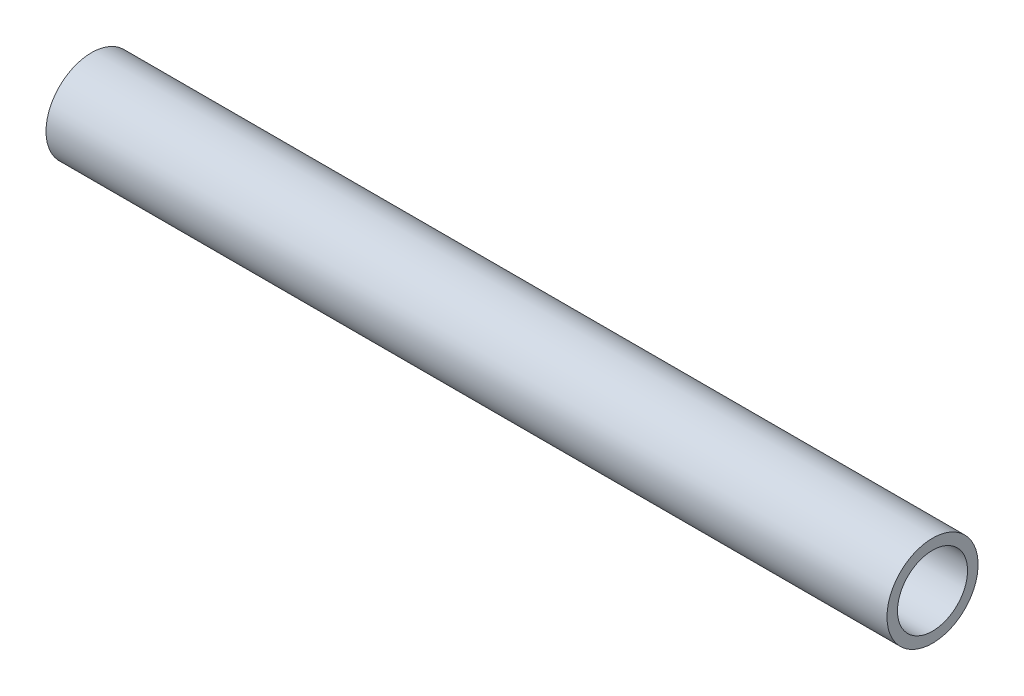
ISO-10303-21;
HEADER;
FILE_DESCRIPTION(('STEP AP214'),'2;1');
FILE_NAME('part.step','',(''),(''),'','','');
FILE_SCHEMA(('AUTOMOTIVE_DESIGN { 1 0 10303 214 1 1 1 1 }'));
ENDSEC;
DATA;
#1=APPLICATION_CONTEXT('core data for automotive mechanical design processes');
#2=APPLICATION_PROTOCOL_DEFINITION('international standard','automotive_design',2000,#1);
#3=PRODUCT_CONTEXT('',#1,'mechanical');
#4=PRODUCT('Part','Part','',(#3));
#5=PRODUCT_RELATED_PRODUCT_CATEGORY('part','',(#4));
#6=PRODUCT_DEFINITION_FORMATION('','',#4);
#7=PRODUCT_DEFINITION_CONTEXT('part definition',#1,'design');
#8=PRODUCT_DEFINITION('design','',#6,#7);
#9=PRODUCT_DEFINITION_SHAPE('','',#8);
#10=(LENGTH_UNIT() NAMED_UNIT(*) SI_UNIT(.MILLI.,.METRE.));
#11=(NAMED_UNIT(*) PLANE_ANGLE_UNIT() SI_UNIT($,.RADIAN.));
#12=(NAMED_UNIT(*) SI_UNIT($,.STERADIAN.) SOLID_ANGLE_UNIT());
#13=UNCERTAINTY_MEASURE_WITH_UNIT(LENGTH_MEASURE(1.E-05),#10,'distance_accuracy_value','');
#14=(GEOMETRIC_REPRESENTATION_CONTEXT(3) GLOBAL_UNCERTAINTY_ASSIGNED_CONTEXT((#13)) GLOBAL_UNIT_ASSIGNED_CONTEXT((#10,
#11,#12)) REPRESENTATION_CONTEXT('',''));
#15=CARTESIAN_POINT('',(0.,0.,0.));
#16=DIRECTION('',(0.,0.,1.));
#17=DIRECTION('',(1.,0.,0.));
#18=AXIS2_PLACEMENT_3D('',#15,#16,#17);
#19=CARTESIAN_POINT('',(304.800000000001,0.,0.));
#20=DIRECTION('',(-1.,0.,0.));
#21=DIRECTION('',(0.,0.,1.00000000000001));
#22=AXIS2_PLACEMENT_3D('',#19,#20,#21);
#23=CYLINDRICAL_SURFACE('',#22,12.7);
#24=CARTESIAN_POINT('',(304.800000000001,0.,0.));
#25=DIRECTION('',(1.,0.,0.));
#26=DIRECTION('',(0.,0.,-1.00000000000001));
#27=AXIS2_PLACEMENT_3D('',#24,#25,#26);
#28=CIRCLE('',#27,12.7);
#29=CARTESIAN_POINT('',(304.800000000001,0.,12.7000000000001));
#30=VERTEX_POINT('',#29);
#31=EDGE_CURVE('E40',#30,#30,#28,.T.);
#32=CARTESIAN_POINT('',(0.,0.,0.));
#33=DIRECTION('',(1.,0.,0.));
#34=DIRECTION('',(0.,0.,-1.00000000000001));
#35=AXIS2_PLACEMENT_3D('',#32,#33,#34);
#36=CIRCLE('',#35,12.7);
#37=CARTESIAN_POINT('',(0.,0.,12.7000000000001));
#38=VERTEX_POINT('',#37);
#39=EDGE_CURVE('E46',#38,#38,#36,.T.);
#40=CARTESIAN_POINT('',(304.800000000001,0.,12.7000000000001));
#41=CARTESIAN_POINT('',(301.625000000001,0.,12.7000000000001));
#42=CARTESIAN_POINT('',(298.450000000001,0.,12.7000000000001));
#43=CARTESIAN_POINT('',(292.100000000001,0.,12.7000000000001));
#44=CARTESIAN_POINT('',(288.925000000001,0.,12.7000000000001));
#45=CARTESIAN_POINT('',(282.575000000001,0.,12.7000000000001));
#46=CARTESIAN_POINT('',(279.400000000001,0.,12.7000000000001));
#47=CARTESIAN_POINT('',(273.050000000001,0.,12.7000000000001));
#48=CARTESIAN_POINT('',(269.875000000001,0.,12.7000000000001));
#49=CARTESIAN_POINT('',(263.525000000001,0.,12.7000000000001));
#50=CARTESIAN_POINT('',(260.350000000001,0.,12.7000000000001));
#51=CARTESIAN_POINT('',(254.000000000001,0.,12.7000000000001));
#52=CARTESIAN_POINT('',(250.825000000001,0.,12.7000000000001));
#53=CARTESIAN_POINT('',(244.475000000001,0.,12.7000000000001));
#54=CARTESIAN_POINT('',(241.300000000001,0.,12.7000000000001));
#55=CARTESIAN_POINT('',(234.950000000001,0.,12.7000000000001));
#56=CARTESIAN_POINT('',(231.775000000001,0.,12.7000000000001));
#57=CARTESIAN_POINT('',(225.425000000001,0.,12.7000000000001));
#58=CARTESIAN_POINT('',(222.250000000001,0.,12.7000000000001));
#59=CARTESIAN_POINT('',(215.900000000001,0.,12.7000000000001));
#60=CARTESIAN_POINT('',(212.725000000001,0.,12.7000000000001));
#61=CARTESIAN_POINT('',(206.375000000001,0.,12.7000000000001));
#62=CARTESIAN_POINT('',(203.200000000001,0.,12.7000000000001));
#63=CARTESIAN_POINT('',(196.850000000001,0.,12.7000000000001));
#64=CARTESIAN_POINT('',(193.675000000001,0.,12.7000000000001));
#65=CARTESIAN_POINT('',(187.325000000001,0.,12.7000000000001));
#66=CARTESIAN_POINT('',(184.150000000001,0.,12.7000000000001));
#67=CARTESIAN_POINT('',(177.800000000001,0.,12.7000000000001));
#68=CARTESIAN_POINT('',(174.625000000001,0.,12.7000000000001));
#69=CARTESIAN_POINT('',(168.275000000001,0.,12.7000000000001));
#70=CARTESIAN_POINT('',(165.100000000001,0.,12.7000000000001));
#71=CARTESIAN_POINT('',(158.750000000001,0.,12.7000000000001));
#72=CARTESIAN_POINT('',(155.575000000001,0.,12.7000000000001));
#73=CARTESIAN_POINT('',(149.225000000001,0.,12.7000000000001));
#74=CARTESIAN_POINT('',(146.050000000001,0.,12.7000000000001));
#75=CARTESIAN_POINT('',(139.700000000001,0.,12.7000000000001));
#76=CARTESIAN_POINT('',(136.525000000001,0.,12.7000000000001));
#77=CARTESIAN_POINT('',(130.175,0.,12.7000000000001));
#78=CARTESIAN_POINT('',(127.,0.,12.7000000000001));
#79=CARTESIAN_POINT('',(120.65,0.,12.7000000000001));
#80=CARTESIAN_POINT('',(117.475,0.,12.7000000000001));
#81=CARTESIAN_POINT('',(111.125,0.,12.7000000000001));
#82=CARTESIAN_POINT('',(107.95,0.,12.7000000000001));
#83=CARTESIAN_POINT('',(101.6,0.,12.7000000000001));
#84=CARTESIAN_POINT('',(98.4250000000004,0.,12.7000000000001));
#85=CARTESIAN_POINT('',(92.0750000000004,0.,12.7000000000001));
#86=CARTESIAN_POINT('',(88.9000000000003,0.,12.7000000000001));
#87=CARTESIAN_POINT('',(82.5500000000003,0.,12.7000000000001));
#88=CARTESIAN_POINT('',(79.3750000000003,0.,12.7000000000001));
#89=CARTESIAN_POINT('',(73.0250000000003,0.,12.7000000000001));
#90=CARTESIAN_POINT('',(69.8500000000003,0.,12.7000000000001));
#91=CARTESIAN_POINT('',(63.5000000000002,0.,12.7000000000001));
#92=CARTESIAN_POINT('',(60.3250000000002,0.,12.7000000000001));
#93=CARTESIAN_POINT('',(53.9750000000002,0.,12.7000000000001));
#94=CARTESIAN_POINT('',(50.8000000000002,0.,12.7000000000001));
#95=CARTESIAN_POINT('',(44.4500000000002,0.,12.7000000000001));
#96=CARTESIAN_POINT('',(41.2750000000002,0.,12.7000000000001));
#97=CARTESIAN_POINT('',(34.9250000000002,0.,12.7000000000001));
#98=CARTESIAN_POINT('',(31.7500000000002,0.,12.7000000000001));
#99=CARTESIAN_POINT('',(25.4000000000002,0.,12.7000000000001));
#100=CARTESIAN_POINT('',(22.2250000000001,0.,12.7000000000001));
#101=CARTESIAN_POINT('',(15.8750000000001,0.,12.7000000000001));
#102=CARTESIAN_POINT('',(12.7000000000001,0.,12.7000000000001));
#103=CARTESIAN_POINT('',(6.3500000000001,0.,12.7000000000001));
#104=CARTESIAN_POINT('',(3.17500000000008,0.,12.7000000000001));
#105=CARTESIAN_POINT('',(0.,0.,12.7000000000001));
#106=B_SPLINE_CURVE_WITH_KNOTS('',3,(#40,#41,#42,#43,#44,#45,#46,#47,#48,#49,#50,#51,#52,#53,
#54,#55,#56,#57,#58,#59,#60,#61,#62,#63,#64,#65,#66,#67,#68,#69,#70,#71,#72,#73,#74,#75,#76,#77,
#78,#79,#80,#81,#82,#83,#84,#85,#86,#87,#88,#89,#90,#91,#92,#93,#94,#95,#96,#97,#98,#99,#100,
#101,#102,#103,#104,#105),.UNSPECIFIED.,.F.,.F.,(4,2,2,2,2,2,2,2,2,2,2,2,2,2,2,2,2,2,2,2,2,2,2,
2,2,2,2,2,2,2,2,2,4),(0.,9.52500000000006,19.0500000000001,28.5750000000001,38.1000000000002,
47.6250000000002,57.1500000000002,66.6750000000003,76.2000000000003,85.7250000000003,
95.2500000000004,104.775,114.3,123.825,133.350000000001,142.875000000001,152.400000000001,
161.925000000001,171.450000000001,180.975000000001,190.500000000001,200.025000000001,
209.550000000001,219.075000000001,228.600000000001,238.125000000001,247.650000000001,
257.175000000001,266.700000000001,276.225000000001,285.750000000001,295.275000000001,
304.800000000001),.UNSPECIFIED.);
#107=EDGE_CURVE('BSEAM33',#30,#38,#106,.T.);
#108=ORIENTED_EDGE('',*,*,#31,.T.);
#109=ORIENTED_EDGE('',*,*,#39,.F.);
#110=ORIENTED_EDGE('',*,*,#107,.T.);
#111=ORIENTED_EDGE('',*,*,#107,.F.);
#112=EDGE_LOOP('',(#108,#110,#109,#111));
#113=FACE_BOUND('',#112,.T.);
#114=ADVANCED_FACE('F33',(#113),#23,.F.);
#115=CARTESIAN_POINT('',(304.800000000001,0.,0.));
#116=DIRECTION('',(-1.,0.,0.));
#117=DIRECTION('',(0.,0.,1.00000000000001));
#118=AXIS2_PLACEMENT_3D('',#115,#116,#117);
#119=CYLINDRICAL_SURFACE('',#118,16.51);
#120=CARTESIAN_POINT('',(304.800000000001,0.,0.));
#121=DIRECTION('',(1.,0.,0.));
#122=DIRECTION('',(0.,0.,-1.00000000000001));
#123=AXIS2_PLACEMENT_3D('',#120,#121,#122);
#124=CIRCLE('',#123,16.51);
#125=CARTESIAN_POINT('',(304.800000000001,0.,16.5100000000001));
#126=VERTEX_POINT('',#125);
#127=EDGE_CURVE('E10',#126,#126,#124,.T.);
#128=CARTESIAN_POINT('',(0.,0.,0.));
#129=DIRECTION('',(1.,0.,0.));
#130=DIRECTION('',(0.,0.,-1.00000000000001));
#131=AXIS2_PLACEMENT_3D('',#128,#129,#130);
#132=CIRCLE('',#131,16.51);
#133=CARTESIAN_POINT('',(0.,0.,16.5100000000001));
#134=VERTEX_POINT('',#133);
#135=EDGE_CURVE('E36',#134,#134,#132,.T.);
#136=CARTESIAN_POINT('',(304.800000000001,0.,16.5100000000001));
#137=CARTESIAN_POINT('',(301.625000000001,0.,16.5100000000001));
#138=CARTESIAN_POINT('',(298.450000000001,0.,16.5100000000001));
#139=CARTESIAN_POINT('',(292.100000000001,0.,16.5100000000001));
#140=CARTESIAN_POINT('',(288.925000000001,0.,16.5100000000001));
#141=CARTESIAN_POINT('',(282.575000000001,0.,16.5100000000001));
#142=CARTESIAN_POINT('',(279.400000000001,0.,16.5100000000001));
#143=CARTESIAN_POINT('',(273.050000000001,0.,16.5100000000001));
#144=CARTESIAN_POINT('',(269.875000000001,0.,16.5100000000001));
#145=CARTESIAN_POINT('',(263.525000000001,0.,16.5100000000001));
#146=CARTESIAN_POINT('',(260.350000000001,0.,16.5100000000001));
#147=CARTESIAN_POINT('',(254.000000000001,0.,16.5100000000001));
#148=CARTESIAN_POINT('',(250.825000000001,0.,16.5100000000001));
#149=CARTESIAN_POINT('',(244.475000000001,0.,16.5100000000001));
#150=CARTESIAN_POINT('',(241.300000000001,0.,16.5100000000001));
#151=CARTESIAN_POINT('',(234.950000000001,0.,16.5100000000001));
#152=CARTESIAN_POINT('',(231.775000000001,0.,16.5100000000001));
#153=CARTESIAN_POINT('',(225.425000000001,0.,16.5100000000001));
#154=CARTESIAN_POINT('',(222.250000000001,0.,16.5100000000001));
#155=CARTESIAN_POINT('',(215.900000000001,0.,16.5100000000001));
#156=CARTESIAN_POINT('',(212.725000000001,0.,16.5100000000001));
#157=CARTESIAN_POINT('',(206.375000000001,0.,16.5100000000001));
#158=CARTESIAN_POINT('',(203.200000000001,0.,16.5100000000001));
#159=CARTESIAN_POINT('',(196.850000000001,0.,16.5100000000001));
#160=CARTESIAN_POINT('',(193.675000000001,0.,16.5100000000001));
#161=CARTESIAN_POINT('',(187.325000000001,0.,16.5100000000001));
#162=CARTESIAN_POINT('',(184.150000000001,0.,16.5100000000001));
#163=CARTESIAN_POINT('',(177.800000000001,0.,16.5100000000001));
#164=CARTESIAN_POINT('',(174.625000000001,0.,16.5100000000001));
#165=CARTESIAN_POINT('',(168.275000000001,0.,16.5100000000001));
#166=CARTESIAN_POINT('',(165.100000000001,0.,16.5100000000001));
#167=CARTESIAN_POINT('',(158.750000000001,0.,16.5100000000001));
#168=CARTESIAN_POINT('',(155.575000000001,0.,16.5100000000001));
#169=CARTESIAN_POINT('',(149.225000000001,0.,16.5100000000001));
#170=CARTESIAN_POINT('',(146.050000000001,0.,16.5100000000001));
#171=CARTESIAN_POINT('',(139.700000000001,0.,16.5100000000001));
#172=CARTESIAN_POINT('',(136.525000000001,0.,16.5100000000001));
#173=CARTESIAN_POINT('',(130.175000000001,0.,16.5100000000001));
#174=CARTESIAN_POINT('',(127.,0.,16.5100000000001));
#175=CARTESIAN_POINT('',(120.65,0.,16.5100000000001));
#176=CARTESIAN_POINT('',(117.475,0.,16.5100000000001));
#177=CARTESIAN_POINT('',(111.125,0.,16.5100000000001));
#178=CARTESIAN_POINT('',(107.95,0.,16.5100000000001));
#179=CARTESIAN_POINT('',(101.6,0.,16.5100000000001));
#180=CARTESIAN_POINT('',(98.4250000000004,0.,16.5100000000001));
#181=CARTESIAN_POINT('',(92.0750000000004,0.,16.5100000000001));
#182=CARTESIAN_POINT('',(88.9000000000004,0.,16.5100000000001));
#183=CARTESIAN_POINT('',(82.5500000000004,0.,16.5100000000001));
#184=CARTESIAN_POINT('',(79.3750000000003,0.,16.5100000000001));
#185=CARTESIAN_POINT('',(73.0250000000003,0.,16.5100000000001));
#186=CARTESIAN_POINT('',(69.8500000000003,0.,16.5100000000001));
#187=CARTESIAN_POINT('',(63.5000000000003,0.,16.5100000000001));
#188=CARTESIAN_POINT('',(60.3250000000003,0.,16.5100000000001));
#189=CARTESIAN_POINT('',(53.9750000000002,0.,16.5100000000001));
#190=CARTESIAN_POINT('',(50.8000000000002,0.,16.5100000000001));
#191=CARTESIAN_POINT('',(44.4500000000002,0.,16.5100000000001));
#192=CARTESIAN_POINT('',(41.2750000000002,0.,16.5100000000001));
#193=CARTESIAN_POINT('',(34.9250000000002,0.,16.5100000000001));
#194=CARTESIAN_POINT('',(31.7500000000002,0.,16.5100000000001));
#195=CARTESIAN_POINT('',(25.4000000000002,0.,16.5100000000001));
#196=CARTESIAN_POINT('',(22.2250000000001,0.,16.5100000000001));
#197=CARTESIAN_POINT('',(15.8750000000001,0.,16.5100000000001));
#198=CARTESIAN_POINT('',(12.7000000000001,0.,16.5100000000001));
#199=CARTESIAN_POINT('',(6.35000000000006,0.,16.5100000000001));
#200=CARTESIAN_POINT('',(3.17500000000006,0.,16.5100000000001));
#201=CARTESIAN_POINT('',(0.,0.,16.5100000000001));
#202=B_SPLINE_CURVE_WITH_KNOTS('',3,(#136,#137,#138,#139,#140,#141,#142,#143,#144,#145,#146,
#147,#148,#149,#150,#151,#152,#153,#154,#155,#156,#157,#158,#159,#160,#161,#162,#163,#164,#165,
#166,#167,#168,#169,#170,#171,#172,#173,#174,#175,#176,#177,#178,#179,#180,#181,#182,#183,#184,
#185,#186,#187,#188,#189,#190,#191,#192,#193,#194,#195,#196,#197,#198,#199,#200,#201),
.UNSPECIFIED.,.F.,.F.,(4,2,2,2,2,2,2,2,2,2,2,2,2,2,2,2,2,2,2,2,2,2,2,2,2,2,2,2,2,2,2,2,4),(0.,
9.52500000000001,19.05,28.5750000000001,38.1000000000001,47.6250000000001,57.1500000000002,
66.6750000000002,76.2000000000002,85.7250000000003,95.2500000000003,104.775,114.3,123.825,
133.35,142.875,152.4,161.925000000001,171.450000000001,180.975000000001,190.500000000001,
200.025000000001,209.550000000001,219.075000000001,228.600000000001,238.125000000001,
247.650000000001,257.175000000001,266.700000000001,276.225000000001,285.750000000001,
295.275000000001,304.800000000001),.UNSPECIFIED.);
#203=EDGE_CURVE('BSEAM53',#126,#134,#202,.T.);
#204=ORIENTED_EDGE('',*,*,#127,.F.);
#205=ORIENTED_EDGE('',*,*,#135,.T.);
#206=ORIENTED_EDGE('',*,*,#203,.T.);
#207=ORIENTED_EDGE('',*,*,#203,.F.);
#208=EDGE_LOOP('',(#204,#206,#205,#207));
#209=FACE_BOUND('',#208,.T.);
#210=ADVANCED_FACE('F53',(#209),#119,.T.);
#211=CARTESIAN_POINT('',(304.800000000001,0.,0.));
#212=DIRECTION('',(1.,0.,0.));
#213=DIRECTION('',(0.,0.,-1.00000000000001));
#214=AXIS2_PLACEMENT_3D('',#211,#212,#213);
#215=PLANE('',#214);
#216=ORIENTED_EDGE('',*,*,#31,.F.);
#217=EDGE_LOOP('',(#216));
#218=FACE_BOUND('',#217,.T.);
#219=ORIENTED_EDGE('',*,*,#127,.T.);
#220=EDGE_LOOP('',(#219));
#221=FACE_BOUND('',#220,.T.);
#222=ADVANCED_FACE('F57',(#218,#221),#215,.T.);
#223=CARTESIAN_POINT('',(0.,0.,0.));
#224=DIRECTION('',(1.,0.,0.));
#225=DIRECTION('',(0.,0.,-1.00000000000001));
#226=AXIS2_PLACEMENT_3D('',#223,#224,#225);
#227=PLANE('',#226);
#228=ORIENTED_EDGE('',*,*,#39,.T.);
#229=EDGE_LOOP('',(#228));
#230=FACE_BOUND('',#229,.T.);
#231=ORIENTED_EDGE('',*,*,#135,.F.);
#232=EDGE_LOOP('',(#231));
#233=FACE_BOUND('',#232,.T.);
#234=ADVANCED_FACE('F55',(#230,#233),#227,.F.);
#235=CLOSED_SHELL('',(#114,#210,#222,#234));
#236=MANIFOLD_SOLID_BREP('B2',#235);
#237=ADVANCED_BREP_SHAPE_REPRESENTATION('',(#18,#236),#14);
#238=SHAPE_DEFINITION_REPRESENTATION(#9,#237);
ENDSEC;
END-ISO-10303-21;
